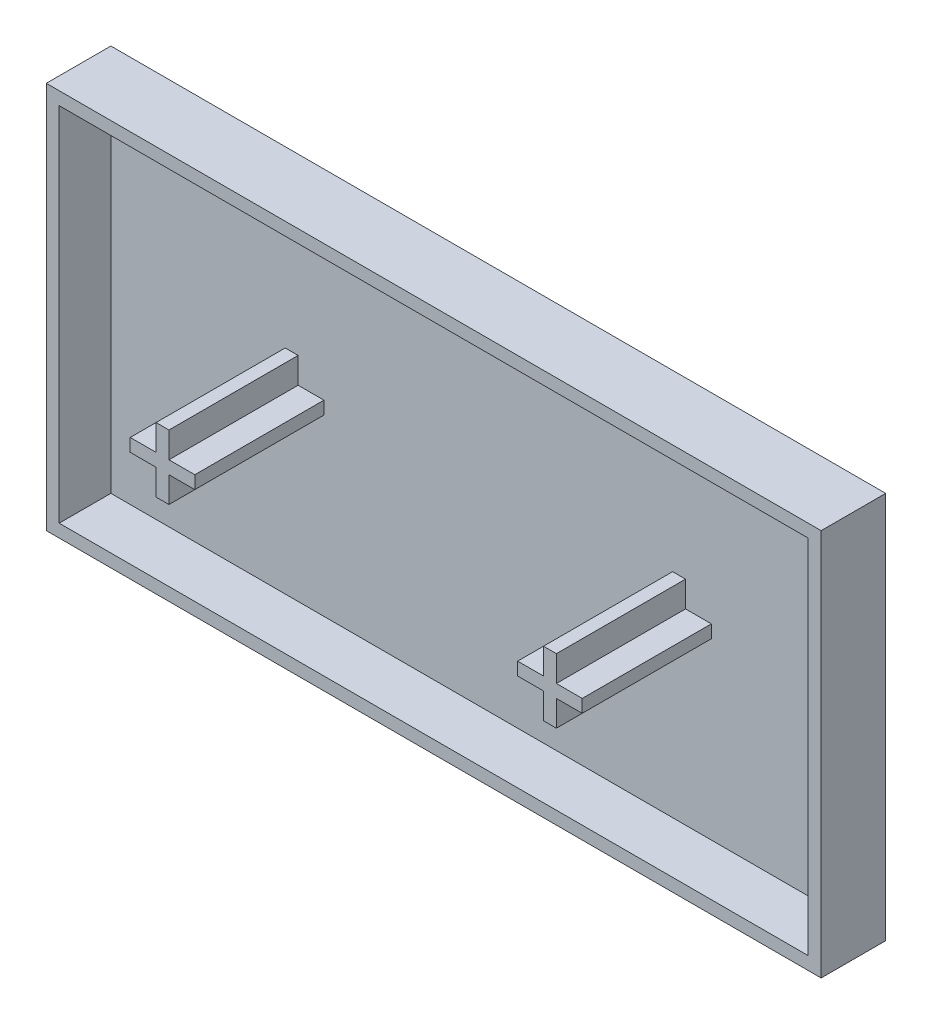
ISO-10303-21;
HEADER;
FILE_DESCRIPTION(('STEP AP214'),'2;1');
FILE_NAME('part.step','',(''),(''),'','','');
FILE_SCHEMA(('AUTOMOTIVE_DESIGN { 1 0 10303 214 1 1 1 1 }'));
ENDSEC;
DATA;
#1=APPLICATION_CONTEXT('core data for automotive mechanical design processes');
#2=APPLICATION_PROTOCOL_DEFINITION('international standard','automotive_design',2000,#1);
#3=PRODUCT_CONTEXT('',#1,'mechanical');
#4=PRODUCT('Part','Part','',(#3));
#5=PRODUCT_RELATED_PRODUCT_CATEGORY('part','',(#4));
#6=PRODUCT_DEFINITION_FORMATION('','',#4);
#7=PRODUCT_DEFINITION_CONTEXT('part definition',#1,'design');
#8=PRODUCT_DEFINITION('design','',#6,#7);
#9=PRODUCT_DEFINITION_SHAPE('','',#8);
#10=(LENGTH_UNIT() NAMED_UNIT(*) SI_UNIT(.MILLI.,.METRE.));
#11=(NAMED_UNIT(*) PLANE_ANGLE_UNIT() SI_UNIT($,.RADIAN.));
#12=(NAMED_UNIT(*) SI_UNIT($,.STERADIAN.) SOLID_ANGLE_UNIT());
#13=UNCERTAINTY_MEASURE_WITH_UNIT(LENGTH_MEASURE(1.E-05),#10,'distance_accuracy_value','');
#14=(GEOMETRIC_REPRESENTATION_CONTEXT(3) GLOBAL_UNCERTAINTY_ASSIGNED_CONTEXT((#13)) GLOBAL_UNIT_ASSIGNED_CONTEXT((#10,
#11,#12)) REPRESENTATION_CONTEXT('',''));
#15=CARTESIAN_POINT('',(0.,0.,0.));
#16=DIRECTION('',(0.,0.,1.));
#17=DIRECTION('',(1.,0.,0.));
#18=AXIS2_PLACEMENT_3D('',#15,#16,#17);
#19=CARTESIAN_POINT('',(0.,0.,-1.5));
#20=DIRECTION('',(0.,0.,1.));
#21=DIRECTION('',(1.,0.,0.));
#22=AXIS2_PLACEMENT_3D('',#19,#20,#21);
#23=PLANE('',#22);
#24=DIRECTION('',(1.,0.,0.));
#25=VECTOR('',#24,1.);
#26=CARTESIAN_POINT('',(-17.5,-0.5,-1.5));
#27=LINE('',#26,#25);
#28=CARTESIAN_POINT('',(-17.5,-0.5,-1.5));
#29=VERTEX_POINT('',#28);
#30=CARTESIAN_POINT('',(-15.5,-0.5,-1.5));
#31=VERTEX_POINT('',#30);
#32=EDGE_CURVE('E271',#29,#31,#27,.T.);
#33=ORIENTED_EDGE('',*,*,#32,.F.);
#34=DIRECTION('',(0.,-1.,0.));
#35=VECTOR('',#34,1.);
#36=CARTESIAN_POINT('',(-17.5,0.5,-1.5));
#37=LINE('',#36,#35);
#38=CARTESIAN_POINT('',(-17.5,0.5,-1.5));
#39=VERTEX_POINT('',#38);
#40=EDGE_CURVE('E268',#39,#29,#37,.T.);
#41=ORIENTED_EDGE('',*,*,#40,.F.);
#42=DIRECTION('',(-1.,0.,0.));
#43=VECTOR('',#42,1.);
#44=CARTESIAN_POINT('',(-17.5,0.5,-1.5));
#45=LINE('',#44,#43);
#46=CARTESIAN_POINT('',(-15.5,0.5,-1.5));
#47=VERTEX_POINT('',#46);
#48=EDGE_CURVE('E281',#47,#39,#45,.T.);
#49=ORIENTED_EDGE('',*,*,#48,.F.);
#50=DIRECTION('',(0.,-1.,0.));
#51=VECTOR('',#50,1.);
#52=CARTESIAN_POINT('',(-15.5,2.5,-1.5));
#53=LINE('',#52,#51);
#54=CARTESIAN_POINT('',(-15.5,2.5,-1.5));
#55=VERTEX_POINT('',#54);
#56=EDGE_CURVE('E321',#55,#47,#53,.T.);
#57=ORIENTED_EDGE('',*,*,#56,.F.);
#58=DIRECTION('',(-1.,0.,0.));
#59=VECTOR('',#58,1.);
#60=CARTESIAN_POINT('',(-15.5,2.5,-1.5));
#61=LINE('',#60,#59);
#62=CARTESIAN_POINT('',(-14.5,2.5,-1.5));
#63=VERTEX_POINT('',#62);
#64=EDGE_CURVE('E319',#63,#55,#61,.T.);
#65=ORIENTED_EDGE('',*,*,#64,.F.);
#66=DIRECTION('',(0.,1.,0.));
#67=VECTOR('',#66,1.);
#68=CARTESIAN_POINT('',(-14.5,2.5,-1.5));
#69=LINE('',#68,#67);
#70=CARTESIAN_POINT('',(-14.5,0.5,-1.5));
#71=VERTEX_POINT('',#70);
#72=EDGE_CURVE('E317',#71,#63,#69,.T.);
#73=ORIENTED_EDGE('',*,*,#72,.F.);
#74=DIRECTION('',(-1.,0.,0.));
#75=VECTOR('',#74,1.);
#76=CARTESIAN_POINT('',(-14.5,0.5,-1.5));
#77=LINE('',#76,#75);
#78=CARTESIAN_POINT('',(-12.5,0.5,-1.5));
#79=VERTEX_POINT('',#78);
#80=EDGE_CURVE('E315',#79,#71,#77,.T.);
#81=ORIENTED_EDGE('',*,*,#80,.F.);
#82=DIRECTION('',(0.,1.,0.));
#83=VECTOR('',#82,1.);
#84=CARTESIAN_POINT('',(-12.5,0.5,-1.5));
#85=LINE('',#84,#83);
#86=CARTESIAN_POINT('',(-12.5,-0.5,-1.5));
#87=VERTEX_POINT('',#86);
#88=EDGE_CURVE('E313',#87,#79,#85,.T.);
#89=ORIENTED_EDGE('',*,*,#88,.F.);
#90=DIRECTION('',(1.,0.,0.));
#91=VECTOR('',#90,1.);
#92=CARTESIAN_POINT('',(-14.5,-0.5,-1.5));
#93=LINE('',#92,#91);
#94=CARTESIAN_POINT('',(-14.5,-0.5,-1.5));
#95=VERTEX_POINT('',#94);
#96=EDGE_CURVE('E311',#95,#87,#93,.T.);
#97=ORIENTED_EDGE('',*,*,#96,.F.);
#98=DIRECTION('',(0.,1.,0.));
#99=VECTOR('',#98,1.);
#100=CARTESIAN_POINT('',(-14.5,-0.5,-1.5));
#101=LINE('',#100,#99);
#102=CARTESIAN_POINT('',(-14.5,-2.5,-1.5));
#103=VERTEX_POINT('',#102);
#104=EDGE_CURVE('E309',#103,#95,#101,.T.);
#105=ORIENTED_EDGE('',*,*,#104,.F.);
#106=DIRECTION('',(1.,0.,0.));
#107=VECTOR('',#106,1.);
#108=CARTESIAN_POINT('',(-15.5,-2.5,-1.5));
#109=LINE('',#108,#107);
#110=CARTESIAN_POINT('',(-15.5,-2.5,-1.5));
#111=VERTEX_POINT('',#110);
#112=EDGE_CURVE('E307',#111,#103,#109,.T.);
#113=ORIENTED_EDGE('',*,*,#112,.F.);
#114=DIRECTION('',(0.,-1.,0.));
#115=VECTOR('',#114,1.);
#116=CARTESIAN_POINT('',(-15.5,-0.5,-1.5));
#117=LINE('',#116,#115);
#118=EDGE_CURVE('E305',#31,#111,#117,.T.);
#119=ORIENTED_EDGE('',*,*,#118,.F.);
#120=EDGE_LOOP('',(#33,#41,#49,#57,#65,#73,#81,#89,#97,#105,#113,#119));
#121=FACE_BOUND('',#120,.T.);
#122=DIRECTION('',(0.,-1.,0.));
#123=VECTOR('',#122,1.);
#124=CARTESIAN_POINT('',(-29.,15.,-1.5));
#125=LINE('',#124,#123);
#126=CARTESIAN_POINT('',(-29.,14.,-1.5));
#127=VERTEX_POINT('',#126);
#128=CARTESIAN_POINT('',(-29.,-14.,-1.5));
#129=VERTEX_POINT('',#128);
#130=EDGE_CURVE('E356',#127,#129,#125,.T.);
#131=ORIENTED_EDGE('',*,*,#130,.T.);
#132=DIRECTION('',(1.,0.,0.));
#133=VECTOR('',#132,1.);
#134=CARTESIAN_POINT('',(-30.,-14.,-1.5));
#135=LINE('',#134,#133);
#136=CARTESIAN_POINT('',(29.,-14.,-1.5));
#137=VERTEX_POINT('',#136);
#138=EDGE_CURVE('E359',#129,#137,#135,.T.);
#139=ORIENTED_EDGE('',*,*,#138,.T.);
#140=DIRECTION('',(0.,1.,0.));
#141=VECTOR('',#140,1.);
#142=CARTESIAN_POINT('',(29.,15.,-1.5));
#143=LINE('',#142,#141);
#144=CARTESIAN_POINT('',(29.,14.,-1.5));
#145=VERTEX_POINT('',#144);
#146=EDGE_CURVE('E371',#137,#145,#143,.T.);
#147=ORIENTED_EDGE('',*,*,#146,.T.);
#148=DIRECTION('',(-1.,0.,0.));
#149=VECTOR('',#148,1.);
#150=CARTESIAN_POINT('',(-30.,14.,-1.5));
#151=LINE('',#150,#149);
#152=EDGE_CURVE('E375',#145,#127,#151,.T.);
#153=ORIENTED_EDGE('',*,*,#152,.T.);
#154=EDGE_LOOP('',(#131,#139,#147,#153));
#155=FACE_BOUND('',#154,.T.);
#156=DIRECTION('',(0.,-1.,0.));
#157=VECTOR('',#156,1.);
#158=CARTESIAN_POINT('',(14.5,-0.5,-1.5));
#159=LINE('',#158,#157);
#160=CARTESIAN_POINT('',(14.5,-0.5,-1.5));
#161=VERTEX_POINT('',#160);
#162=CARTESIAN_POINT('',(14.5,-2.5,-1.5));
#163=VERTEX_POINT('',#162);
#164=EDGE_CURVE('E789',#161,#163,#159,.T.);
#165=ORIENTED_EDGE('',*,*,#164,.F.);
#166=DIRECTION('',(1.,0.,0.));
#167=VECTOR('',#166,1.);
#168=CARTESIAN_POINT('',(14.5,-0.5,-1.5));
#169=LINE('',#168,#167);
#170=CARTESIAN_POINT('',(12.5,-0.5,-1.5));
#171=VERTEX_POINT('',#170);
#172=EDGE_CURVE('E266',#171,#161,#169,.T.);
#173=ORIENTED_EDGE('',*,*,#172,.F.);
#174=DIRECTION('',(0.,-1.,0.));
#175=VECTOR('',#174,1.);
#176=CARTESIAN_POINT('',(12.5,0.5,-1.5));
#177=LINE('',#176,#175);
#178=CARTESIAN_POINT('',(12.5,0.5,-1.5));
#179=VERTEX_POINT('',#178);
#180=EDGE_CURVE('E262',#179,#171,#177,.T.);
#181=ORIENTED_EDGE('',*,*,#180,.F.);
#182=DIRECTION('',(-1.,0.,0.));
#183=VECTOR('',#182,1.);
#184=CARTESIAN_POINT('',(14.5,0.5,-1.5));
#185=LINE('',#184,#183);
#186=CARTESIAN_POINT('',(14.5,0.5,-1.5));
#187=VERTEX_POINT('',#186);
#188=EDGE_CURVE('E785',#187,#179,#185,.T.);
#189=ORIENTED_EDGE('',*,*,#188,.F.);
#190=DIRECTION('',(0.,-1.,0.));
#191=VECTOR('',#190,1.);
#192=CARTESIAN_POINT('',(14.5,2.5,-1.5));
#193=LINE('',#192,#191);
#194=CARTESIAN_POINT('',(14.5,2.5,-1.5));
#195=VERTEX_POINT('',#194);
#196=EDGE_CURVE('E809',#195,#187,#193,.T.);
#197=ORIENTED_EDGE('',*,*,#196,.F.);
#198=DIRECTION('',(-1.,0.,0.));
#199=VECTOR('',#198,1.);
#200=CARTESIAN_POINT('',(15.5,2.5,-1.5));
#201=LINE('',#200,#199);
#202=CARTESIAN_POINT('',(15.5,2.5,-1.5));
#203=VERTEX_POINT('',#202);
#204=EDGE_CURVE('E807',#203,#195,#201,.T.);
#205=ORIENTED_EDGE('',*,*,#204,.F.);
#206=DIRECTION('',(0.,1.,0.));
#207=VECTOR('',#206,1.);
#208=CARTESIAN_POINT('',(15.5,2.5,-1.5));
#209=LINE('',#208,#207);
#210=CARTESIAN_POINT('',(15.5,0.5,-1.5));
#211=VERTEX_POINT('',#210);
#212=EDGE_CURVE('E805',#211,#203,#209,.T.);
#213=ORIENTED_EDGE('',*,*,#212,.F.);
#214=DIRECTION('',(-1.,0.,0.));
#215=VECTOR('',#214,1.);
#216=CARTESIAN_POINT('',(17.5,0.5,-1.5));
#217=LINE('',#216,#215);
#218=CARTESIAN_POINT('',(17.5,0.5,-1.5));
#219=VERTEX_POINT('',#218);
#220=EDGE_CURVE('E803',#219,#211,#217,.T.);
#221=ORIENTED_EDGE('',*,*,#220,.F.);
#222=DIRECTION('',(0.,1.,0.));
#223=VECTOR('',#222,1.);
#224=CARTESIAN_POINT('',(17.5,0.5,-1.5));
#225=LINE('',#224,#223);
#226=CARTESIAN_POINT('',(17.5,-0.5,-1.5));
#227=VERTEX_POINT('',#226);
#228=EDGE_CURVE('E801',#227,#219,#225,.T.);
#229=ORIENTED_EDGE('',*,*,#228,.F.);
#230=DIRECTION('',(1.,0.,0.));
#231=VECTOR('',#230,1.);
#232=CARTESIAN_POINT('',(17.5,-0.5,-1.5));
#233=LINE('',#232,#231);
#234=CARTESIAN_POINT('',(15.5,-0.5,-1.5));
#235=VERTEX_POINT('',#234);
#236=EDGE_CURVE('E799',#235,#227,#233,.T.);
#237=ORIENTED_EDGE('',*,*,#236,.F.);
#238=DIRECTION('',(0.,1.,0.));
#239=VECTOR('',#238,1.);
#240=CARTESIAN_POINT('',(15.5,-0.5,-1.5));
#241=LINE('',#240,#239);
#242=CARTESIAN_POINT('',(15.5,-2.5,-1.5));
#243=VERTEX_POINT('',#242);
#244=EDGE_CURVE('E797',#243,#235,#241,.T.);
#245=ORIENTED_EDGE('',*,*,#244,.F.);
#246=DIRECTION('',(1.,0.,0.));
#247=VECTOR('',#246,1.);
#248=CARTESIAN_POINT('',(15.5,-2.5,-1.5));
#249=LINE('',#248,#247);
#250=EDGE_CURVE('E791',#163,#243,#249,.T.);
#251=ORIENTED_EDGE('',*,*,#250,.F.);
#252=EDGE_LOOP('',(#165,#173,#181,#189,#197,#205,#213,#221,#229,#237,#245,#251));
#253=FACE_BOUND('',#252,.T.);
#254=ADVANCED_FACE('F33',(#121,#155,#253),#23,.T.);
#255=CARTESIAN_POINT('',(-30.,15.,2.5));
#256=DIRECTION('',(1.,0.,0.));
#257=DIRECTION('',(0.,1.,0.));
#258=AXIS2_PLACEMENT_3D('',#255,#256,#257);
#259=PLANE('',#258);
#260=DIRECTION('',(0.,-1.,0.));
#261=VECTOR('',#260,1.);
#262=CARTESIAN_POINT('',(-30.,15.,-2.5));
#263=LINE('',#262,#261);
#264=CARTESIAN_POINT('',(-30.,15.,-2.5));
#265=VERTEX_POINT('',#264);
#266=CARTESIAN_POINT('',(-30.,-15.,-2.5));
#267=VERTEX_POINT('',#266);
#268=EDGE_CURVE('E363',#265,#267,#263,.T.);
#269=ORIENTED_EDGE('',*,*,#268,.T.);
#270=DIRECTION('',(0.,0.,-1.));
#271=VECTOR('',#270,1.);
#272=CARTESIAN_POINT('',(-30.,-15.,2.5));
#273=LINE('',#272,#271);
#274=CARTESIAN_POINT('',(-30.,-15.,2.5));
#275=VERTEX_POINT('',#274);
#276=EDGE_CURVE('E11',#275,#267,#273,.T.);
#277=ORIENTED_EDGE('',*,*,#276,.F.);
#278=DIRECTION('',(0.,-1.,0.));
#279=VECTOR('',#278,1.);
#280=CARTESIAN_POINT('',(-30.,15.,2.5));
#281=LINE('',#280,#279);
#282=CARTESIAN_POINT('',(-30.,15.,2.5));
#283=VERTEX_POINT('',#282);
#284=EDGE_CURVE('E387',#283,#275,#281,.T.);
#285=ORIENTED_EDGE('',*,*,#284,.F.);
#286=DIRECTION('',(0.,0.,-1.));
#287=VECTOR('',#286,1.);
#288=CARTESIAN_POINT('',(-30.,15.,2.5));
#289=LINE('',#288,#287);
#290=EDGE_CURVE('E397',#283,#265,#289,.T.);
#291=ORIENTED_EDGE('',*,*,#290,.T.);
#292=EDGE_LOOP('',(#269,#277,#285,#291));
#293=FACE_BOUND('',#292,.T.);
#294=ADVANCED_FACE('F35',(#293),#259,.F.);
#295=CARTESIAN_POINT('',(-30.,-15.,2.5));
#296=DIRECTION('',(0.,1.,0.));
#297=DIRECTION('',(0.,0.,1.));
#298=AXIS2_PLACEMENT_3D('',#295,#296,#297);
#299=PLANE('',#298);
#300=DIRECTION('',(1.,0.,0.));
#301=VECTOR('',#300,1.);
#302=CARTESIAN_POINT('',(-30.,-15.,-2.5));
#303=LINE('',#302,#301);
#304=CARTESIAN_POINT('',(30.,-15.,-2.5));
#305=VERTEX_POINT('',#304);
#306=EDGE_CURVE('E400',#267,#305,#303,.T.);
#307=ORIENTED_EDGE('',*,*,#306,.T.);
#308=DIRECTION('',(0.,0.,-1.));
#309=VECTOR('',#308,1.);
#310=CARTESIAN_POINT('',(30.,-15.,2.5));
#311=LINE('',#310,#309);
#312=CARTESIAN_POINT('',(30.,-15.,2.5));
#313=VERTEX_POINT('',#312);
#314=EDGE_CURVE('E41',#313,#305,#311,.T.);
#315=ORIENTED_EDGE('',*,*,#314,.F.);
#316=DIRECTION('',(1.,0.,0.));
#317=VECTOR('',#316,1.);
#318=CARTESIAN_POINT('',(-30.,-15.,2.5));
#319=LINE('',#318,#317);
#320=EDGE_CURVE('E390',#275,#313,#319,.T.);
#321=ORIENTED_EDGE('',*,*,#320,.F.);
#322=ORIENTED_EDGE('',*,*,#276,.T.);
#323=EDGE_LOOP('',(#307,#315,#321,#322));
#324=FACE_BOUND('',#323,.T.);
#325=ADVANCED_FACE('F430',(#324),#299,.F.);
#326=CARTESIAN_POINT('',(30.,15.,2.5));
#327=DIRECTION('',(-1.,0.,0.));
#328=DIRECTION('',(0.,-1.,0.));
#329=AXIS2_PLACEMENT_3D('',#326,#327,#328);
#330=PLANE('',#329);
#331=DIRECTION('',(0.,1.,0.));
#332=VECTOR('',#331,1.);
#333=CARTESIAN_POINT('',(30.,15.,-2.5));
#334=LINE('',#333,#332);
#335=CARTESIAN_POINT('',(30.,15.,-2.5));
#336=VERTEX_POINT('',#335);
#337=EDGE_CURVE('E402',#305,#336,#334,.T.);
#338=ORIENTED_EDGE('',*,*,#337,.T.);
#339=DIRECTION('',(0.,0.,-1.));
#340=VECTOR('',#339,1.);
#341=CARTESIAN_POINT('',(30.,15.,2.5));
#342=LINE('',#341,#340);
#343=CARTESIAN_POINT('',(30.,15.,2.5));
#344=VERTEX_POINT('',#343);
#345=EDGE_CURVE('E407',#344,#336,#342,.T.);
#346=ORIENTED_EDGE('',*,*,#345,.F.);
#347=DIRECTION('',(0.,1.,0.));
#348=VECTOR('',#347,1.);
#349=CARTESIAN_POINT('',(30.,15.,2.5));
#350=LINE('',#349,#348);
#351=EDGE_CURVE('E393',#313,#344,#350,.T.);
#352=ORIENTED_EDGE('',*,*,#351,.F.);
#353=ORIENTED_EDGE('',*,*,#314,.T.);
#354=EDGE_LOOP('',(#338,#346,#352,#353));
#355=FACE_BOUND('',#354,.T.);
#356=ADVANCED_FACE('F414',(#355),#330,.F.);
#357=CARTESIAN_POINT('',(-30.,15.,2.5));
#358=DIRECTION('',(0.,-1.,0.));
#359=DIRECTION('',(0.,0.,-1.));
#360=AXIS2_PLACEMENT_3D('',#357,#358,#359);
#361=PLANE('',#360);
#362=DIRECTION('',(-1.,0.,0.));
#363=VECTOR('',#362,1.);
#364=CARTESIAN_POINT('',(-30.,15.,-2.5));
#365=LINE('',#364,#363);
#366=EDGE_CURVE('E391',#336,#265,#365,.T.);
#367=ORIENTED_EDGE('',*,*,#366,.T.);
#368=ORIENTED_EDGE('',*,*,#290,.F.);
#369=DIRECTION('',(-1.,0.,0.));
#370=VECTOR('',#369,1.);
#371=CARTESIAN_POINT('',(-30.,15.,2.5));
#372=LINE('',#371,#370);
#373=EDGE_CURVE('E395',#344,#283,#372,.T.);
#374=ORIENTED_EDGE('',*,*,#373,.F.);
#375=ORIENTED_EDGE('',*,*,#345,.T.);
#376=EDGE_LOOP('',(#367,#368,#374,#375));
#377=FACE_BOUND('',#376,.T.);
#378=ADVANCED_FACE('F423',(#377),#361,.F.);
#379=CARTESIAN_POINT('',(0.,0.,2.5));
#380=DIRECTION('',(0.,0.,1.));
#381=DIRECTION('',(1.,0.,0.));
#382=AXIS2_PLACEMENT_3D('',#379,#380,#381);
#383=PLANE('',#382);
#384=DIRECTION('',(0.,-1.,0.));
#385=VECTOR('',#384,1.);
#386=CARTESIAN_POINT('',(-29.,15.,2.5));
#387=LINE('',#386,#385);
#388=CARTESIAN_POINT('',(-29.,14.,2.5));
#389=VERTEX_POINT('',#388);
#390=CARTESIAN_POINT('',(-29.,-14.,2.5));
#391=VERTEX_POINT('',#390);
#392=EDGE_CURVE('E379',#389,#391,#387,.T.);
#393=ORIENTED_EDGE('',*,*,#392,.F.);
#394=DIRECTION('',(-1.,0.,0.));
#395=VECTOR('',#394,1.);
#396=CARTESIAN_POINT('',(-30.,14.,2.5));
#397=LINE('',#396,#395);
#398=CARTESIAN_POINT('',(29.,14.,2.5));
#399=VERTEX_POINT('',#398);
#400=EDGE_CURVE('E369',#399,#389,#397,.T.);
#401=ORIENTED_EDGE('',*,*,#400,.F.);
#402=DIRECTION('',(0.,1.,0.));
#403=VECTOR('',#402,1.);
#404=CARTESIAN_POINT('',(29.,15.,2.5));
#405=LINE('',#404,#403);
#406=CARTESIAN_POINT('',(29.,-14.,2.5));
#407=VERTEX_POINT('',#406);
#408=EDGE_CURVE('E383',#407,#399,#405,.T.);
#409=ORIENTED_EDGE('',*,*,#408,.F.);
#410=DIRECTION('',(1.,0.,0.));
#411=VECTOR('',#410,1.);
#412=CARTESIAN_POINT('',(-30.,-14.,2.5));
#413=LINE('',#412,#411);
#414=EDGE_CURVE('E381',#391,#407,#413,.T.);
#415=ORIENTED_EDGE('',*,*,#414,.F.);
#416=EDGE_LOOP('',(#393,#401,#409,#415));
#417=FACE_BOUND('',#416,.T.);
#418=ORIENTED_EDGE('',*,*,#284,.T.);
#419=ORIENTED_EDGE('',*,*,#320,.T.);
#420=ORIENTED_EDGE('',*,*,#351,.T.);
#421=ORIENTED_EDGE('',*,*,#373,.T.);
#422=EDGE_LOOP('',(#418,#419,#420,#421));
#423=FACE_BOUND('',#422,.T.);
#424=ADVANCED_FACE('F429',(#417,#423),#383,.T.);
#425=CARTESIAN_POINT('',(0.,0.,-2.5));
#426=DIRECTION('',(0.,0.,1.));
#427=DIRECTION('',(1.,0.,0.));
#428=AXIS2_PLACEMENT_3D('',#425,#426,#427);
#429=PLANE('',#428);
#430=ORIENTED_EDGE('',*,*,#268,.F.);
#431=ORIENTED_EDGE('',*,*,#366,.F.);
#432=ORIENTED_EDGE('',*,*,#337,.F.);
#433=ORIENTED_EDGE('',*,*,#306,.F.);
#434=EDGE_LOOP('',(#430,#431,#432,#433));
#435=FACE_BOUND('',#434,.T.);
#436=ADVANCED_FACE('F420',(#435),#429,.F.);
#437=CARTESIAN_POINT('',(-29.,15.,2.5));
#438=DIRECTION('',(1.,0.,0.));
#439=DIRECTION('',(0.,1.,0.));
#440=AXIS2_PLACEMENT_3D('',#437,#438,#439);
#441=PLANE('',#440);
#442=ORIENTED_EDGE('',*,*,#130,.F.);
#443=DIRECTION('',(0.,0.,-1.));
#444=VECTOR('',#443,1.);
#445=CARTESIAN_POINT('',(-29.,14.,2.5));
#446=LINE('',#445,#444);
#447=EDGE_CURVE('E365',#389,#127,#446,.T.);
#448=ORIENTED_EDGE('',*,*,#447,.F.);
#449=ORIENTED_EDGE('',*,*,#392,.T.);
#450=DIRECTION('',(0.,0.,-1.));
#451=VECTOR('',#450,1.);
#452=CARTESIAN_POINT('',(-29.,-14.,2.5));
#453=LINE('',#452,#451);
#454=EDGE_CURVE('E360',#391,#129,#453,.T.);
#455=ORIENTED_EDGE('',*,*,#454,.T.);
#456=EDGE_LOOP('',(#442,#448,#449,#455));
#457=FACE_BOUND('',#456,.T.);
#458=ADVANCED_FACE('F453',(#457),#441,.T.);
#459=CARTESIAN_POINT('',(-30.,-14.,2.5));
#460=DIRECTION('',(0.,1.,0.));
#461=DIRECTION('',(0.,0.,1.));
#462=AXIS2_PLACEMENT_3D('',#459,#460,#461);
#463=PLANE('',#462);
#464=ORIENTED_EDGE('',*,*,#138,.F.);
#465=ORIENTED_EDGE('',*,*,#454,.F.);
#466=ORIENTED_EDGE('',*,*,#414,.T.);
#467=DIRECTION('',(0.,0.,-1.));
#468=VECTOR('',#467,1.);
#469=CARTESIAN_POINT('',(29.,-14.,2.5));
#470=LINE('',#469,#468);
#471=EDGE_CURVE('E364',#407,#137,#470,.T.);
#472=ORIENTED_EDGE('',*,*,#471,.T.);
#473=EDGE_LOOP('',(#464,#465,#466,#472));
#474=FACE_BOUND('',#473,.T.);
#475=ADVANCED_FACE('F473',(#474),#463,.T.);
#476=CARTESIAN_POINT('',(29.,15.,2.5));
#477=DIRECTION('',(-1.,0.,0.));
#478=DIRECTION('',(0.,-1.,0.));
#479=AXIS2_PLACEMENT_3D('',#476,#477,#478);
#480=PLANE('',#479);
#481=ORIENTED_EDGE('',*,*,#146,.F.);
#482=ORIENTED_EDGE('',*,*,#471,.F.);
#483=ORIENTED_EDGE('',*,*,#408,.T.);
#484=DIRECTION('',(0.,0.,-1.));
#485=VECTOR('',#484,1.);
#486=CARTESIAN_POINT('',(29.,14.,2.5));
#487=LINE('',#486,#485);
#488=EDGE_CURVE('E368',#399,#145,#487,.T.);
#489=ORIENTED_EDGE('',*,*,#488,.T.);
#490=EDGE_LOOP('',(#481,#482,#483,#489));
#491=FACE_BOUND('',#490,.T.);
#492=ADVANCED_FACE('F481',(#491),#480,.T.);
#493=CARTESIAN_POINT('',(-30.,14.,2.5));
#494=DIRECTION('',(0.,-1.,0.));
#495=DIRECTION('',(0.,0.,-1.));
#496=AXIS2_PLACEMENT_3D('',#493,#494,#495);
#497=PLANE('',#496);
#498=ORIENTED_EDGE('',*,*,#152,.F.);
#499=ORIENTED_EDGE('',*,*,#488,.F.);
#500=ORIENTED_EDGE('',*,*,#400,.T.);
#501=ORIENTED_EDGE('',*,*,#447,.T.);
#502=EDGE_LOOP('',(#498,#499,#500,#501));
#503=FACE_BOUND('',#502,.T.);
#504=ADVANCED_FACE('F446',(#503),#497,.T.);
#505=CARTESIAN_POINT('',(-17.5,0.5,8.5));
#506=DIRECTION('',(1.,0.,0.));
#507=DIRECTION('',(0.,0.,-1.));
#508=AXIS2_PLACEMENT_3D('',#505,#506,#507);
#509=PLANE('',#508);
#510=ORIENTED_EDGE('',*,*,#40,.T.);
#511=DIRECTION('',(0.,0.,-1.));
#512=VECTOR('',#511,1.);
#513=CARTESIAN_POINT('',(-17.5,-0.5,8.5));
#514=LINE('',#513,#512);
#515=CARTESIAN_POINT('',(-17.5,-0.5,8.5));
#516=VERTEX_POINT('',#515);
#517=EDGE_CURVE('E354',#516,#29,#514,.T.);
#518=ORIENTED_EDGE('',*,*,#517,.F.);
#519=DIRECTION('',(0.,-1.,0.));
#520=VECTOR('',#519,1.);
#521=CARTESIAN_POINT('',(-17.5,0.5,8.5));
#522=LINE('',#521,#520);
#523=CARTESIAN_POINT('',(-17.5,0.5,8.5));
#524=VERTEX_POINT('',#523);
#525=EDGE_CURVE('E277',#524,#516,#522,.T.);
#526=ORIENTED_EDGE('',*,*,#525,.F.);
#527=DIRECTION('',(0.,0.,-1.));
#528=VECTOR('',#527,1.);
#529=CARTESIAN_POINT('',(-17.5,0.5,8.5));
#530=LINE('',#529,#528);
#531=EDGE_CURVE('E302',#524,#39,#530,.T.);
#532=ORIENTED_EDGE('',*,*,#531,.T.);
#533=EDGE_LOOP('',(#510,#518,#526,#532));
#534=FACE_BOUND('',#533,.T.);
#535=ADVANCED_FACE('F495',(#534),#509,.F.);
#536=CARTESIAN_POINT('',(-17.5,-0.5,8.5));
#537=DIRECTION('',(0.,1.,0.));
#538=DIRECTION('',(0.,0.,1.));
#539=AXIS2_PLACEMENT_3D('',#536,#537,#538);
#540=PLANE('',#539);
#541=ORIENTED_EDGE('',*,*,#32,.T.);
#542=DIRECTION('',(0.,0.,-1.));
#543=VECTOR('',#542,1.);
#544=CARTESIAN_POINT('',(-15.5,-0.5,8.5));
#545=LINE('',#544,#543);
#546=CARTESIAN_POINT('',(-15.5,-0.5,8.5));
#547=VERTEX_POINT('',#546);
#548=EDGE_CURVE('E351',#547,#31,#545,.T.);
#549=ORIENTED_EDGE('',*,*,#548,.F.);
#550=DIRECTION('',(1.,0.,0.));
#551=VECTOR('',#550,1.);
#552=CARTESIAN_POINT('',(-17.5,-0.5,8.5));
#553=LINE('',#552,#551);
#554=EDGE_CURVE('E280',#516,#547,#553,.T.);
#555=ORIENTED_EDGE('',*,*,#554,.F.);
#556=ORIENTED_EDGE('',*,*,#517,.T.);
#557=EDGE_LOOP('',(#541,#549,#555,#556));
#558=FACE_BOUND('',#557,.T.);
#559=ADVANCED_FACE('F502',(#558),#540,.F.);
#560=CARTESIAN_POINT('',(-15.5,-0.5,8.5));
#561=DIRECTION('',(1.,0.,0.));
#562=DIRECTION('',(0.,1.,0.));
#563=AXIS2_PLACEMENT_3D('',#560,#561,#562);
#564=PLANE('',#563);
#565=ORIENTED_EDGE('',*,*,#118,.T.);
#566=DIRECTION('',(0.,0.,-1.));
#567=VECTOR('',#566,1.);
#568=CARTESIAN_POINT('',(-15.5,-2.5,8.5));
#569=LINE('',#568,#567);
#570=CARTESIAN_POINT('',(-15.5,-2.5,8.5));
#571=VERTEX_POINT('',#570);
#572=EDGE_CURVE('E348',#571,#111,#569,.T.);
#573=ORIENTED_EDGE('',*,*,#572,.F.);
#574=DIRECTION('',(0.,-1.,0.));
#575=VECTOR('',#574,1.);
#576=CARTESIAN_POINT('',(-15.5,-0.5,8.5));
#577=LINE('',#576,#575);
#578=EDGE_CURVE('E283',#547,#571,#577,.T.);
#579=ORIENTED_EDGE('',*,*,#578,.F.);
#580=ORIENTED_EDGE('',*,*,#548,.T.);
#581=EDGE_LOOP('',(#565,#573,#579,#580));
#582=FACE_BOUND('',#581,.T.);
#583=ADVANCED_FACE('F510',(#582),#564,.F.);
#584=CARTESIAN_POINT('',(-15.5,-2.5,8.5));
#585=DIRECTION('',(0.,1.,0.));
#586=DIRECTION('',(0.,0.,1.));
#587=AXIS2_PLACEMENT_3D('',#584,#585,#586);
#588=PLANE('',#587);
#589=ORIENTED_EDGE('',*,*,#112,.T.);
#590=DIRECTION('',(0.,0.,-1.));
#591=VECTOR('',#590,1.);
#592=CARTESIAN_POINT('',(-14.5,-2.5,8.5));
#593=LINE('',#592,#591);
#594=CARTESIAN_POINT('',(-14.5,-2.5,8.5));
#595=VERTEX_POINT('',#594);
#596=EDGE_CURVE('E345',#595,#103,#593,.T.);
#597=ORIENTED_EDGE('',*,*,#596,.F.);
#598=DIRECTION('',(1.,0.,0.));
#599=VECTOR('',#598,1.);
#600=CARTESIAN_POINT('',(-15.5,-2.5,8.5));
#601=LINE('',#600,#599);
#602=EDGE_CURVE('E285',#571,#595,#601,.T.);
#603=ORIENTED_EDGE('',*,*,#602,.F.);
#604=ORIENTED_EDGE('',*,*,#572,.T.);
#605=EDGE_LOOP('',(#589,#597,#603,#604));
#606=FACE_BOUND('',#605,.T.);
#607=ADVANCED_FACE('F518',(#606),#588,.F.);
#608=CARTESIAN_POINT('',(-14.5,-0.5,8.5));
#609=DIRECTION('',(-1.,0.,0.));
#610=DIRECTION('',(0.,-1.,0.));
#611=AXIS2_PLACEMENT_3D('',#608,#609,#610);
#612=PLANE('',#611);
#613=ORIENTED_EDGE('',*,*,#104,.T.);
#614=DIRECTION('',(0.,0.,-1.));
#615=VECTOR('',#614,1.);
#616=CARTESIAN_POINT('',(-14.5,-0.5,8.5));
#617=LINE('',#616,#615);
#618=CARTESIAN_POINT('',(-14.5,-0.5,8.5));
#619=VERTEX_POINT('',#618);
#620=EDGE_CURVE('E342',#619,#95,#617,.T.);
#621=ORIENTED_EDGE('',*,*,#620,.F.);
#622=DIRECTION('',(0.,1.,0.));
#623=VECTOR('',#622,1.);
#624=CARTESIAN_POINT('',(-14.5,-0.5,8.5));
#625=LINE('',#624,#623);
#626=EDGE_CURVE('E287',#595,#619,#625,.T.);
#627=ORIENTED_EDGE('',*,*,#626,.F.);
#628=ORIENTED_EDGE('',*,*,#596,.T.);
#629=EDGE_LOOP('',(#613,#621,#627,#628));
#630=FACE_BOUND('',#629,.T.);
#631=ADVANCED_FACE('F526',(#630),#612,.F.);
#632=CARTESIAN_POINT('',(-14.5,-0.5,8.5));
#633=DIRECTION('',(0.,1.,0.));
#634=DIRECTION('',(0.,0.,1.));
#635=AXIS2_PLACEMENT_3D('',#632,#633,#634);
#636=PLANE('',#635);
#637=ORIENTED_EDGE('',*,*,#96,.T.);
#638=DIRECTION('',(0.,0.,-1.));
#639=VECTOR('',#638,1.);
#640=CARTESIAN_POINT('',(-12.5,-0.5,8.5));
#641=LINE('',#640,#639);
#642=CARTESIAN_POINT('',(-12.5,-0.5,8.5));
#643=VERTEX_POINT('',#642);
#644=EDGE_CURVE('E339',#643,#87,#641,.T.);
#645=ORIENTED_EDGE('',*,*,#644,.F.);
#646=DIRECTION('',(1.,0.,0.));
#647=VECTOR('',#646,1.);
#648=CARTESIAN_POINT('',(-14.5,-0.5,8.5));
#649=LINE('',#648,#647);
#650=EDGE_CURVE('E289',#619,#643,#649,.T.);
#651=ORIENTED_EDGE('',*,*,#650,.F.);
#652=ORIENTED_EDGE('',*,*,#620,.T.);
#653=EDGE_LOOP('',(#637,#645,#651,#652));
#654=FACE_BOUND('',#653,.T.);
#655=ADVANCED_FACE('F534',(#654),#636,.F.);
#656=CARTESIAN_POINT('',(-12.5,0.5,8.5));
#657=DIRECTION('',(-1.,0.,0.));
#658=DIRECTION('',(0.,-1.,0.));
#659=AXIS2_PLACEMENT_3D('',#656,#657,#658);
#660=PLANE('',#659);
#661=ORIENTED_EDGE('',*,*,#88,.T.);
#662=DIRECTION('',(0.,0.,-1.));
#663=VECTOR('',#662,1.);
#664=CARTESIAN_POINT('',(-12.5,0.5,8.5));
#665=LINE('',#664,#663);
#666=CARTESIAN_POINT('',(-12.5,0.5,8.5));
#667=VERTEX_POINT('',#666);
#668=EDGE_CURVE('E336',#667,#79,#665,.T.);
#669=ORIENTED_EDGE('',*,*,#668,.F.);
#670=DIRECTION('',(0.,1.,0.));
#671=VECTOR('',#670,1.);
#672=CARTESIAN_POINT('',(-12.5,0.5,8.5));
#673=LINE('',#672,#671);
#674=EDGE_CURVE('E291',#643,#667,#673,.T.);
#675=ORIENTED_EDGE('',*,*,#674,.F.);
#676=ORIENTED_EDGE('',*,*,#644,.T.);
#677=EDGE_LOOP('',(#661,#669,#675,#676));
#678=FACE_BOUND('',#677,.T.);
#679=ADVANCED_FACE('F542',(#678),#660,.F.);
#680=CARTESIAN_POINT('',(-14.5,0.5,8.5));
#681=DIRECTION('',(0.,-1.,0.));
#682=DIRECTION('',(0.,0.,-1.));
#683=AXIS2_PLACEMENT_3D('',#680,#681,#682);
#684=PLANE('',#683);
#685=ORIENTED_EDGE('',*,*,#80,.T.);
#686=DIRECTION('',(0.,0.,-1.));
#687=VECTOR('',#686,1.);
#688=CARTESIAN_POINT('',(-14.5,0.5,8.5));
#689=LINE('',#688,#687);
#690=CARTESIAN_POINT('',(-14.5,0.5,8.5));
#691=VERTEX_POINT('',#690);
#692=EDGE_CURVE('E333',#691,#71,#689,.T.);
#693=ORIENTED_EDGE('',*,*,#692,.F.);
#694=DIRECTION('',(-1.,0.,0.));
#695=VECTOR('',#694,1.);
#696=CARTESIAN_POINT('',(-14.5,0.5,8.5));
#697=LINE('',#696,#695);
#698=EDGE_CURVE('E293',#667,#691,#697,.T.);
#699=ORIENTED_EDGE('',*,*,#698,.F.);
#700=ORIENTED_EDGE('',*,*,#668,.T.);
#701=EDGE_LOOP('',(#685,#693,#699,#700));
#702=FACE_BOUND('',#701,.T.);
#703=ADVANCED_FACE('F550',(#702),#684,.F.);
#704=CARTESIAN_POINT('',(-14.5,2.5,8.5));
#705=DIRECTION('',(-1.,0.,0.));
#706=DIRECTION('',(0.,-1.,0.));
#707=AXIS2_PLACEMENT_3D('',#704,#705,#706);
#708=PLANE('',#707);
#709=ORIENTED_EDGE('',*,*,#72,.T.);
#710=DIRECTION('',(0.,0.,-1.));
#711=VECTOR('',#710,1.);
#712=CARTESIAN_POINT('',(-14.5,2.5,8.5));
#713=LINE('',#712,#711);
#714=CARTESIAN_POINT('',(-14.5,2.5,8.5));
#715=VERTEX_POINT('',#714);
#716=EDGE_CURVE('E330',#715,#63,#713,.T.);
#717=ORIENTED_EDGE('',*,*,#716,.F.);
#718=DIRECTION('',(0.,1.,0.));
#719=VECTOR('',#718,1.);
#720=CARTESIAN_POINT('',(-14.5,2.5,8.5));
#721=LINE('',#720,#719);
#722=EDGE_CURVE('E295',#691,#715,#721,.T.);
#723=ORIENTED_EDGE('',*,*,#722,.F.);
#724=ORIENTED_EDGE('',*,*,#692,.T.);
#725=EDGE_LOOP('',(#709,#717,#723,#724));
#726=FACE_BOUND('',#725,.T.);
#727=ADVANCED_FACE('F558',(#726),#708,.F.);
#728=CARTESIAN_POINT('',(-15.5,2.5,8.5));
#729=DIRECTION('',(0.,-1.,0.));
#730=DIRECTION('',(0.,0.,-1.));
#731=AXIS2_PLACEMENT_3D('',#728,#729,#730);
#732=PLANE('',#731);
#733=ORIENTED_EDGE('',*,*,#64,.T.);
#734=DIRECTION('',(0.,0.,-1.));
#735=VECTOR('',#734,1.);
#736=CARTESIAN_POINT('',(-15.5,2.5,8.5));
#737=LINE('',#736,#735);
#738=CARTESIAN_POINT('',(-15.5,2.5,8.5));
#739=VERTEX_POINT('',#738);
#740=EDGE_CURVE('E327',#739,#55,#737,.T.);
#741=ORIENTED_EDGE('',*,*,#740,.F.);
#742=DIRECTION('',(-1.,0.,0.));
#743=VECTOR('',#742,1.);
#744=CARTESIAN_POINT('',(-15.5,2.5,8.5));
#745=LINE('',#744,#743);
#746=EDGE_CURVE('E297',#715,#739,#745,.T.);
#747=ORIENTED_EDGE('',*,*,#746,.F.);
#748=ORIENTED_EDGE('',*,*,#716,.T.);
#749=EDGE_LOOP('',(#733,#741,#747,#748));
#750=FACE_BOUND('',#749,.T.);
#751=ADVANCED_FACE('F566',(#750),#732,.F.);
#752=CARTESIAN_POINT('',(-15.5,2.5,8.5));
#753=DIRECTION('',(1.,0.,0.));
#754=DIRECTION('',(0.,0.,-1.));
#755=AXIS2_PLACEMENT_3D('',#752,#753,#754);
#756=PLANE('',#755);
#757=ORIENTED_EDGE('',*,*,#56,.T.);
#758=DIRECTION('',(0.,0.,-1.));
#759=VECTOR('',#758,1.);
#760=CARTESIAN_POINT('',(-15.5,0.5,8.5));
#761=LINE('',#760,#759);
#762=CARTESIAN_POINT('',(-15.5,0.5,8.5));
#763=VERTEX_POINT('',#762);
#764=EDGE_CURVE('E56',#763,#47,#761,.T.);
#765=ORIENTED_EDGE('',*,*,#764,.F.);
#766=DIRECTION('',(0.,-1.,0.));
#767=VECTOR('',#766,1.);
#768=CARTESIAN_POINT('',(-15.5,2.5,8.5));
#769=LINE('',#768,#767);
#770=EDGE_CURVE('E299',#739,#763,#769,.T.);
#771=ORIENTED_EDGE('',*,*,#770,.F.);
#772=ORIENTED_EDGE('',*,*,#740,.T.);
#773=EDGE_LOOP('',(#757,#765,#771,#772));
#774=FACE_BOUND('',#773,.T.);
#775=ADVANCED_FACE('F574',(#774),#756,.F.);
#776=CARTESIAN_POINT('',(-17.5,0.5,8.5));
#777=DIRECTION('',(0.,-1.,0.));
#778=DIRECTION('',(0.,0.,-1.));
#779=AXIS2_PLACEMENT_3D('',#776,#777,#778);
#780=PLANE('',#779);
#781=ORIENTED_EDGE('',*,*,#48,.T.);
#782=ORIENTED_EDGE('',*,*,#531,.F.);
#783=DIRECTION('',(-1.,0.,0.));
#784=VECTOR('',#783,1.);
#785=CARTESIAN_POINT('',(-17.5,0.5,8.5));
#786=LINE('',#785,#784);
#787=EDGE_CURVE('E301',#763,#524,#786,.T.);
#788=ORIENTED_EDGE('',*,*,#787,.F.);
#789=ORIENTED_EDGE('',*,*,#764,.T.);
#790=EDGE_LOOP('',(#781,#782,#788,#789));
#791=FACE_BOUND('',#790,.T.);
#792=ADVANCED_FACE('F582',(#791),#780,.F.);
#793=CARTESIAN_POINT('',(0.,0.,8.5));
#794=DIRECTION('',(0.,0.,1.));
#795=DIRECTION('',(1.,0.,0.));
#796=AXIS2_PLACEMENT_3D('',#793,#794,#795);
#797=PLANE('',#796);
#798=ORIENTED_EDGE('',*,*,#525,.T.);
#799=ORIENTED_EDGE('',*,*,#554,.T.);
#800=ORIENTED_EDGE('',*,*,#578,.T.);
#801=ORIENTED_EDGE('',*,*,#602,.T.);
#802=ORIENTED_EDGE('',*,*,#626,.T.);
#803=ORIENTED_EDGE('',*,*,#650,.T.);
#804=ORIENTED_EDGE('',*,*,#674,.T.);
#805=ORIENTED_EDGE('',*,*,#698,.T.);
#806=ORIENTED_EDGE('',*,*,#722,.T.);
#807=ORIENTED_EDGE('',*,*,#746,.T.);
#808=ORIENTED_EDGE('',*,*,#770,.T.);
#809=ORIENTED_EDGE('',*,*,#787,.T.);
#810=EDGE_LOOP('',(#798,#799,#800,#801,#802,#803,#804,#805,#806,#807,#808,#809));
#811=FACE_BOUND('',#810,.T.);
#812=ADVANCED_FACE('F590',(#811),#797,.T.);
#813=CARTESIAN_POINT('',(14.5,-0.5,8.5));
#814=DIRECTION('',(0.,1.,0.));
#815=DIRECTION('',(0.,0.,1.));
#816=AXIS2_PLACEMENT_3D('',#813,#814,#815);
#817=PLANE('',#816);
#818=ORIENTED_EDGE('',*,*,#172,.T.);
#819=DIRECTION('',(0.,0.,-1.));
#820=VECTOR('',#819,1.);
#821=CARTESIAN_POINT('',(14.5,-0.5,8.5));
#822=LINE('',#821,#820);
#823=CARTESIAN_POINT('',(14.5,-0.5,8.5));
#824=VERTEX_POINT('',#823);
#825=EDGE_CURVE('E247',#824,#161,#822,.T.);
#826=ORIENTED_EDGE('',*,*,#825,.F.);
#827=DIRECTION('',(1.,0.,0.));
#828=VECTOR('',#827,1.);
#829=CARTESIAN_POINT('',(14.5,-0.5,8.5));
#830=LINE('',#829,#828);
#831=CARTESIAN_POINT('',(12.5,-0.5,8.5));
#832=VERTEX_POINT('',#831);
#833=EDGE_CURVE('E254',#832,#824,#830,.T.);
#834=ORIENTED_EDGE('',*,*,#833,.F.);
#835=DIRECTION('',(0.,0.,-1.));
#836=VECTOR('',#835,1.);
#837=CARTESIAN_POINT('',(12.5,-0.5,8.5));
#838=LINE('',#837,#836);
#839=EDGE_CURVE('E782',#832,#171,#838,.T.);
#840=ORIENTED_EDGE('',*,*,#839,.T.);
#841=EDGE_LOOP('',(#818,#826,#834,#840));
#842=FACE_BOUND('',#841,.T.);
#843=ADVANCED_FACE('F264',(#842),#817,.F.);
#844=CARTESIAN_POINT('',(14.5,-0.5,8.5));
#845=DIRECTION('',(1.,0.,0.));
#846=DIRECTION('',(0.,1.,0.));
#847=AXIS2_PLACEMENT_3D('',#844,#845,#846);
#848=PLANE('',#847);
#849=ORIENTED_EDGE('',*,*,#164,.T.);
#850=DIRECTION('',(0.,0.,-1.));
#851=VECTOR('',#850,1.);
#852=CARTESIAN_POINT('',(14.5,-2.5,8.5));
#853=LINE('',#852,#851);
#854=CARTESIAN_POINT('',(14.5,-2.5,8.5));
#855=VERTEX_POINT('',#854);
#856=EDGE_CURVE('E250',#855,#163,#853,.T.);
#857=ORIENTED_EDGE('',*,*,#856,.F.);
#858=DIRECTION('',(0.,-1.,0.));
#859=VECTOR('',#858,1.);
#860=CARTESIAN_POINT('',(14.5,-0.5,8.5));
#861=LINE('',#860,#859);
#862=EDGE_CURVE('E243',#824,#855,#861,.T.);
#863=ORIENTED_EDGE('',*,*,#862,.F.);
#864=ORIENTED_EDGE('',*,*,#825,.T.);
#865=EDGE_LOOP('',(#849,#857,#863,#864));
#866=FACE_BOUND('',#865,.T.);
#867=ADVANCED_FACE('F245',(#866),#848,.F.);
#868=CARTESIAN_POINT('',(15.5,-2.5,8.5));
#869=DIRECTION('',(0.,1.,0.));
#870=DIRECTION('',(0.,0.,1.));
#871=AXIS2_PLACEMENT_3D('',#868,#869,#870);
#872=PLANE('',#871);
#873=ORIENTED_EDGE('',*,*,#250,.T.);
#874=DIRECTION('',(0.,0.,-1.));
#875=VECTOR('',#874,1.);
#876=CARTESIAN_POINT('',(15.5,-2.5,8.5));
#877=LINE('',#876,#875);
#878=CARTESIAN_POINT('',(15.5,-2.5,8.5));
#879=VERTEX_POINT('',#878);
#880=EDGE_CURVE('E273',#879,#243,#877,.T.);
#881=ORIENTED_EDGE('',*,*,#880,.F.);
#882=DIRECTION('',(1.,0.,0.));
#883=VECTOR('',#882,1.);
#884=CARTESIAN_POINT('',(15.5,-2.5,8.5));
#885=LINE('',#884,#883);
#886=EDGE_CURVE('E253',#855,#879,#885,.T.);
#887=ORIENTED_EDGE('',*,*,#886,.F.);
#888=ORIENTED_EDGE('',*,*,#856,.T.);
#889=EDGE_LOOP('',(#873,#881,#887,#888));
#890=FACE_BOUND('',#889,.T.);
#891=ADVANCED_FACE('F610',(#890),#872,.F.);
#892=CARTESIAN_POINT('',(15.5,-0.5,8.5));
#893=DIRECTION('',(-1.,0.,0.));
#894=DIRECTION('',(0.,-1.,0.));
#895=AXIS2_PLACEMENT_3D('',#892,#893,#894);
#896=PLANE('',#895);
#897=ORIENTED_EDGE('',*,*,#244,.T.);
#898=DIRECTION('',(0.,0.,-1.));
#899=VECTOR('',#898,1.);
#900=CARTESIAN_POINT('',(15.5,-0.5,8.5));
#901=LINE('',#900,#899);
#902=CARTESIAN_POINT('',(15.5,-0.5,8.5));
#903=VERTEX_POINT('',#902);
#904=EDGE_CURVE('E831',#903,#235,#901,.T.);
#905=ORIENTED_EDGE('',*,*,#904,.F.);
#906=DIRECTION('',(0.,1.,0.));
#907=VECTOR('',#906,1.);
#908=CARTESIAN_POINT('',(15.5,-0.5,8.5));
#909=LINE('',#908,#907);
#910=EDGE_CURVE('E838',#879,#903,#909,.T.);
#911=ORIENTED_EDGE('',*,*,#910,.F.);
#912=ORIENTED_EDGE('',*,*,#880,.T.);
#913=EDGE_LOOP('',(#897,#905,#911,#912));
#914=FACE_BOUND('',#913,.T.);
#915=ADVANCED_FACE('F617',(#914),#896,.F.);
#916=CARTESIAN_POINT('',(17.5,-0.5,8.5));
#917=DIRECTION('',(0.,1.,0.));
#918=DIRECTION('',(0.,0.,1.));
#919=AXIS2_PLACEMENT_3D('',#916,#917,#918);
#920=PLANE('',#919);
#921=ORIENTED_EDGE('',*,*,#236,.T.);
#922=DIRECTION('',(0.,0.,-1.));
#923=VECTOR('',#922,1.);
#924=CARTESIAN_POINT('',(17.5,-0.5,8.5));
#925=LINE('',#924,#923);
#926=CARTESIAN_POINT('',(17.5,-0.5,8.5));
#927=VERTEX_POINT('',#926);
#928=EDGE_CURVE('E828',#927,#227,#925,.T.);
#929=ORIENTED_EDGE('',*,*,#928,.F.);
#930=DIRECTION('',(1.,0.,0.));
#931=VECTOR('',#930,1.);
#932=CARTESIAN_POINT('',(17.5,-0.5,8.5));
#933=LINE('',#932,#931);
#934=EDGE_CURVE('E849',#903,#927,#933,.T.);
#935=ORIENTED_EDGE('',*,*,#934,.F.);
#936=ORIENTED_EDGE('',*,*,#904,.T.);
#937=EDGE_LOOP('',(#921,#929,#935,#936));
#938=FACE_BOUND('',#937,.T.);
#939=ADVANCED_FACE('F625',(#938),#920,.F.);
#940=CARTESIAN_POINT('',(17.5,0.5,8.5));
#941=DIRECTION('',(-1.,0.,0.));
#942=DIRECTION('',(0.,0.,1.));
#943=AXIS2_PLACEMENT_3D('',#940,#941,#942);
#944=PLANE('',#943);
#945=ORIENTED_EDGE('',*,*,#228,.T.);
#946=DIRECTION('',(0.,0.,-1.));
#947=VECTOR('',#946,1.);
#948=CARTESIAN_POINT('',(17.5,0.5,8.5));
#949=LINE('',#948,#947);
#950=CARTESIAN_POINT('',(17.5,0.5,8.5));
#951=VERTEX_POINT('',#950);
#952=EDGE_CURVE('E825',#951,#219,#949,.T.);
#953=ORIENTED_EDGE('',*,*,#952,.F.);
#954=DIRECTION('',(0.,1.,0.));
#955=VECTOR('',#954,1.);
#956=CARTESIAN_POINT('',(17.5,0.5,8.5));
#957=LINE('',#956,#955);
#958=EDGE_CURVE('E846',#927,#951,#957,.T.);
#959=ORIENTED_EDGE('',*,*,#958,.F.);
#960=ORIENTED_EDGE('',*,*,#928,.T.);
#961=EDGE_LOOP('',(#945,#953,#959,#960));
#962=FACE_BOUND('',#961,.T.);
#963=ADVANCED_FACE('F633',(#962),#944,.F.);
#964=CARTESIAN_POINT('',(17.5,0.5,8.5));
#965=DIRECTION('',(0.,-1.,0.));
#966=DIRECTION('',(0.,0.,-1.));
#967=AXIS2_PLACEMENT_3D('',#964,#965,#966);
#968=PLANE('',#967);
#969=ORIENTED_EDGE('',*,*,#220,.T.);
#970=DIRECTION('',(0.,0.,-1.));
#971=VECTOR('',#970,1.);
#972=CARTESIAN_POINT('',(15.5,0.5,8.5));
#973=LINE('',#972,#971);
#974=CARTESIAN_POINT('',(15.5,0.5,8.5));
#975=VERTEX_POINT('',#974);
#976=EDGE_CURVE('E822',#975,#211,#973,.T.);
#977=ORIENTED_EDGE('',*,*,#976,.F.);
#978=DIRECTION('',(-1.,0.,0.));
#979=VECTOR('',#978,1.);
#980=CARTESIAN_POINT('',(17.5,0.5,8.5));
#981=LINE('',#980,#979);
#982=EDGE_CURVE('E848',#951,#975,#981,.T.);
#983=ORIENTED_EDGE('',*,*,#982,.F.);
#984=ORIENTED_EDGE('',*,*,#952,.T.);
#985=EDGE_LOOP('',(#969,#977,#983,#984));
#986=FACE_BOUND('',#985,.T.);
#987=ADVANCED_FACE('F641',(#986),#968,.F.);
#988=CARTESIAN_POINT('',(15.5,2.5,8.5));
#989=DIRECTION('',(-1.,0.,0.));
#990=DIRECTION('',(0.,0.,1.));
#991=AXIS2_PLACEMENT_3D('',#988,#989,#990);
#992=PLANE('',#991);
#993=ORIENTED_EDGE('',*,*,#212,.T.);
#994=DIRECTION('',(0.,0.,-1.));
#995=VECTOR('',#994,1.);
#996=CARTESIAN_POINT('',(15.5,2.5,8.5));
#997=LINE('',#996,#995);
#998=CARTESIAN_POINT('',(15.5,2.5,8.5));
#999=VERTEX_POINT('',#998);
#1000=EDGE_CURVE('E819',#999,#203,#997,.T.);
#1001=ORIENTED_EDGE('',*,*,#1000,.F.);
#1002=DIRECTION('',(0.,1.,0.));
#1003=VECTOR('',#1002,1.);
#1004=CARTESIAN_POINT('',(15.5,2.5,8.5));
#1005=LINE('',#1004,#1003);
#1006=EDGE_CURVE('E851',#975,#999,#1005,.T.);
#1007=ORIENTED_EDGE('',*,*,#1006,.F.);
#1008=ORIENTED_EDGE('',*,*,#976,.T.);
#1009=EDGE_LOOP('',(#993,#1001,#1007,#1008));
#1010=FACE_BOUND('',#1009,.T.);
#1011=ADVANCED_FACE('F649',(#1010),#992,.F.);
#1012=CARTESIAN_POINT('',(15.5,2.5,8.5));
#1013=DIRECTION('',(0.,-1.,0.));
#1014=DIRECTION('',(0.,0.,-1.));
#1015=AXIS2_PLACEMENT_3D('',#1012,#1013,#1014);
#1016=PLANE('',#1015);
#1017=ORIENTED_EDGE('',*,*,#204,.T.);
#1018=DIRECTION('',(0.,0.,-1.));
#1019=VECTOR('',#1018,1.);
#1020=CARTESIAN_POINT('',(14.5,2.5,8.5));
#1021=LINE('',#1020,#1019);
#1022=CARTESIAN_POINT('',(14.5,2.5,8.5));
#1023=VERTEX_POINT('',#1022);
#1024=EDGE_CURVE('E816',#1023,#195,#1021,.T.);
#1025=ORIENTED_EDGE('',*,*,#1024,.F.);
#1026=DIRECTION('',(-1.,0.,0.));
#1027=VECTOR('',#1026,1.);
#1028=CARTESIAN_POINT('',(15.5,2.5,8.5));
#1029=LINE('',#1028,#1027);
#1030=EDGE_CURVE('E857',#999,#1023,#1029,.T.);
#1031=ORIENTED_EDGE('',*,*,#1030,.F.);
#1032=ORIENTED_EDGE('',*,*,#1000,.T.);
#1033=EDGE_LOOP('',(#1017,#1025,#1031,#1032));
#1034=FACE_BOUND('',#1033,.T.);
#1035=ADVANCED_FACE('F657',(#1034),#1016,.F.);
#1036=CARTESIAN_POINT('',(14.5,2.5,8.5));
#1037=DIRECTION('',(1.,0.,0.));
#1038=DIRECTION('',(0.,1.,0.));
#1039=AXIS2_PLACEMENT_3D('',#1036,#1037,#1038);
#1040=PLANE('',#1039);
#1041=ORIENTED_EDGE('',*,*,#196,.T.);
#1042=DIRECTION('',(0.,0.,-1.));
#1043=VECTOR('',#1042,1.);
#1044=CARTESIAN_POINT('',(14.5,0.5,8.5));
#1045=LINE('',#1044,#1043);
#1046=CARTESIAN_POINT('',(14.5,0.5,8.5));
#1047=VERTEX_POINT('',#1046);
#1048=EDGE_CURVE('E813',#1047,#187,#1045,.T.);
#1049=ORIENTED_EDGE('',*,*,#1048,.F.);
#1050=DIRECTION('',(0.,-1.,0.));
#1051=VECTOR('',#1050,1.);
#1052=CARTESIAN_POINT('',(14.5,2.5,8.5));
#1053=LINE('',#1052,#1051);
#1054=EDGE_CURVE('E859',#1023,#1047,#1053,.T.);
#1055=ORIENTED_EDGE('',*,*,#1054,.F.);
#1056=ORIENTED_EDGE('',*,*,#1024,.T.);
#1057=EDGE_LOOP('',(#1041,#1049,#1055,#1056));
#1058=FACE_BOUND('',#1057,.T.);
#1059=ADVANCED_FACE('F665',(#1058),#1040,.F.);
#1060=CARTESIAN_POINT('',(14.5,0.5,8.5));
#1061=DIRECTION('',(0.,-1.,0.));
#1062=DIRECTION('',(0.,0.,-1.));
#1063=AXIS2_PLACEMENT_3D('',#1060,#1061,#1062);
#1064=PLANE('',#1063);
#1065=ORIENTED_EDGE('',*,*,#188,.T.);
#1066=DIRECTION('',(0.,0.,-1.));
#1067=VECTOR('',#1066,1.);
#1068=CARTESIAN_POINT('',(12.5,0.5,8.5));
#1069=LINE('',#1068,#1067);
#1070=CARTESIAN_POINT('',(12.5,0.5,8.5));
#1071=VERTEX_POINT('',#1070);
#1072=EDGE_CURVE('E48',#1071,#179,#1069,.T.);
#1073=ORIENTED_EDGE('',*,*,#1072,.F.);
#1074=DIRECTION('',(-1.,0.,0.));
#1075=VECTOR('',#1074,1.);
#1076=CARTESIAN_POINT('',(14.5,0.5,8.5));
#1077=LINE('',#1076,#1075);
#1078=EDGE_CURVE('E860',#1047,#1071,#1077,.T.);
#1079=ORIENTED_EDGE('',*,*,#1078,.F.);
#1080=ORIENTED_EDGE('',*,*,#1048,.T.);
#1081=EDGE_LOOP('',(#1065,#1073,#1079,#1080));
#1082=FACE_BOUND('',#1081,.T.);
#1083=ADVANCED_FACE('F673',(#1082),#1064,.F.);
#1084=CARTESIAN_POINT('',(12.5,0.5,8.5));
#1085=DIRECTION('',(1.,0.,0.));
#1086=DIRECTION('',(0.,1.,0.));
#1087=AXIS2_PLACEMENT_3D('',#1084,#1085,#1086);
#1088=PLANE('',#1087);
#1089=ORIENTED_EDGE('',*,*,#180,.T.);
#1090=ORIENTED_EDGE('',*,*,#839,.F.);
#1091=DIRECTION('',(0.,-1.,0.));
#1092=VECTOR('',#1091,1.);
#1093=CARTESIAN_POINT('',(12.5,0.5,8.5));
#1094=LINE('',#1093,#1092);
#1095=EDGE_CURVE('E258',#1071,#832,#1094,.T.);
#1096=ORIENTED_EDGE('',*,*,#1095,.F.);
#1097=ORIENTED_EDGE('',*,*,#1072,.T.);
#1098=EDGE_LOOP('',(#1089,#1090,#1096,#1097));
#1099=FACE_BOUND('',#1098,.T.);
#1100=ADVANCED_FACE('F681',(#1099),#1088,.F.);
#1101=CARTESIAN_POINT('',(0.,0.,8.5));
#1102=DIRECTION('',(0.,0.,1.));
#1103=DIRECTION('',(1.,0.,0.));
#1104=AXIS2_PLACEMENT_3D('',#1101,#1102,#1103);
#1105=PLANE('',#1104);
#1106=ORIENTED_EDGE('',*,*,#833,.T.);
#1107=ORIENTED_EDGE('',*,*,#862,.T.);
#1108=ORIENTED_EDGE('',*,*,#886,.T.);
#1109=ORIENTED_EDGE('',*,*,#910,.T.);
#1110=ORIENTED_EDGE('',*,*,#934,.T.);
#1111=ORIENTED_EDGE('',*,*,#958,.T.);
#1112=ORIENTED_EDGE('',*,*,#982,.T.);
#1113=ORIENTED_EDGE('',*,*,#1006,.T.);
#1114=ORIENTED_EDGE('',*,*,#1030,.T.);
#1115=ORIENTED_EDGE('',*,*,#1054,.T.);
#1116=ORIENTED_EDGE('',*,*,#1078,.T.);
#1117=ORIENTED_EDGE('',*,*,#1095,.T.);
#1118=EDGE_LOOP('',(#1106,#1107,#1108,#1109,#1110,#1111,#1112,#1113,#1114,#1115,#1116,#1117));
#1119=FACE_BOUND('',#1118,.T.);
#1120=ADVANCED_FACE('F257',(#1119),#1105,.T.);
#1121=CLOSED_SHELL('',(#254,#294,#325,#356,#378,#424,#436,#458,#475,#492,#504,#535,#559,#583,
#607,#631,#655,#679,#703,#727,#751,#775,#792,#812,#843,#867,#891,#915,#939,#963,#987,#1011,
#1035,#1059,#1083,#1100,#1120));
#1122=MANIFOLD_SOLID_BREP('B2',#1121);
#1123=ADVANCED_BREP_SHAPE_REPRESENTATION('',(#18,#1122),#14);
#1124=SHAPE_DEFINITION_REPRESENTATION(#9,#1123);
ENDSEC;
END-ISO-10303-21;
